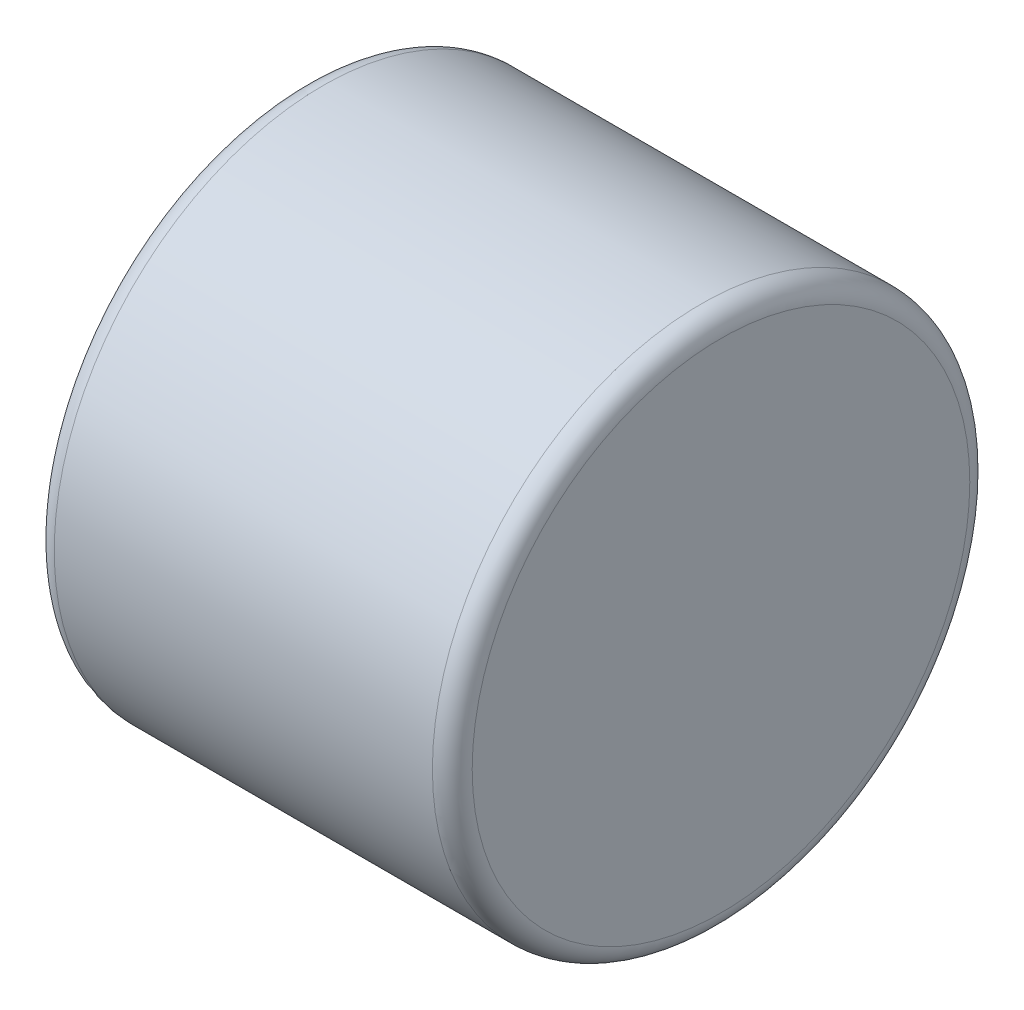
from build123d import *

# Parameters (mm, degrees)
ESQUISSE1_W = 4.2
ESQUISSE1_H = 2.7
CONG_1_R    = 0.2


with BuildPart() as part:
    # Esquisse1 → Base-R_volution (revolve)
    with BuildSketch(Plane.XY, mode=Mode.PRIVATE) as base_r_volution_sk:
        with Locations((0, 1.35)):
            Rectangle(ESQUISSE1_W, ESQUISSE1_H)
    revolve(base_r_volution_sk.sketch.rotate(Axis((3.2, 0, 0), (-1, 0, 0)), 90), axis=Axis((3.2, 0, 0), (-1, 0, 0)))

    # Cong_1
    cong_1_edges = [part.edges().sort_by_distance(p)[0] for p in [
        (2.1, 0, 2.7),
        (-2.1, 0, 2.7),
    ]]
    fillet(cong_1_edges, radius=CONG_1_R)


solid = part.part
